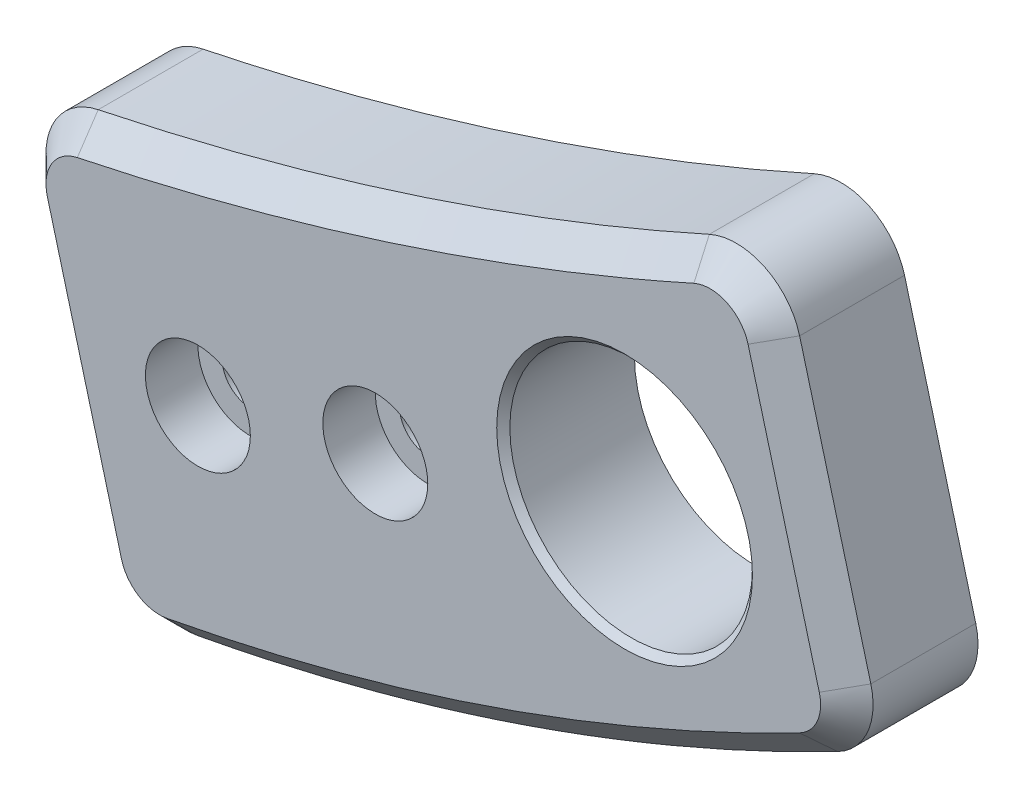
ISO-10303-21;
HEADER;
FILE_DESCRIPTION(('STEP AP214'),'2;1');
FILE_NAME('part.step','',(''),(''),'','','');
FILE_SCHEMA(('AUTOMOTIVE_DESIGN { 1 0 10303 214 1 1 1 1 }'));
ENDSEC;
DATA;
#1=APPLICATION_CONTEXT('core data for automotive mechanical design processes');
#2=APPLICATION_PROTOCOL_DEFINITION('international standard','automotive_design',2000,#1);
#3=PRODUCT_CONTEXT('',#1,'mechanical');
#4=PRODUCT('Part','Part','',(#3));
#5=PRODUCT_RELATED_PRODUCT_CATEGORY('part','',(#4));
#6=PRODUCT_DEFINITION_FORMATION('','',#4);
#7=PRODUCT_DEFINITION_CONTEXT('part definition',#1,'design');
#8=PRODUCT_DEFINITION('design','',#6,#7);
#9=PRODUCT_DEFINITION_SHAPE('','',#8);
#10=(LENGTH_UNIT() NAMED_UNIT(*) SI_UNIT(.MILLI.,.METRE.));
#11=(NAMED_UNIT(*) PLANE_ANGLE_UNIT() SI_UNIT($,.RADIAN.));
#12=(NAMED_UNIT(*) SI_UNIT($,.STERADIAN.) SOLID_ANGLE_UNIT());
#13=UNCERTAINTY_MEASURE_WITH_UNIT(LENGTH_MEASURE(1.E-05),#10,'distance_accuracy_value','');
#14=(GEOMETRIC_REPRESENTATION_CONTEXT(3) GLOBAL_UNCERTAINTY_ASSIGNED_CONTEXT((#13)) GLOBAL_UNIT_ASSIGNED_CONTEXT((#10,
#11,#12)) REPRESENTATION_CONTEXT('',''));
#15=CARTESIAN_POINT('',(0.,0.,0.));
#16=DIRECTION('',(0.,0.,1.));
#17=DIRECTION('',(1.,0.,0.));
#18=AXIS2_PLACEMENT_3D('',#15,#16,#17);
#19=CARTESIAN_POINT('',(45.7938400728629,-131.897870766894,4.));
#20=DIRECTION('',(0.,0.,1.));
#21=DIRECTION('',(-0.965925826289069,-0.25881904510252,0.));
#22=AXIS2_PLACEMENT_3D('',#19,#20,#21);
#23=ELLIPSE('',#22,130.28,94.5);
#24=DIRECTION('',(0.,0.,-1.));
#25=VECTOR('',#24,1.);
#26=SURFACE_OF_LINEAR_EXTRUSION('',#23,#25);
#27=DIRECTION('',(0.,0.,-1.));
#28=VECTOR('',#27,1.);
#29=CARTESIAN_POINT('',(105.704191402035,-209.472004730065,0.));
#30=LINE('',#29,#28);
#31=CARTESIAN_POINT('',(105.704191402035,-209.472004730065,0.));
#32=VERTEX_POINT('',#31);
#33=CARTESIAN_POINT('',(105.704191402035,-209.472004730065,7.99999999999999));
#34=VERTEX_POINT('',#33);
#35=EDGE_CURVE('E145',#32,#34,#30,.F.);
#36=ORIENTED_EDGE('',*,*,#35,.T.);
#37=CARTESIAN_POINT('',(45.7938400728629,-131.897870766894,7.99999999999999));
#38=DIRECTION('',(0.,0.,-1.));
#39=DIRECTION('',(-0.965925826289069,-0.25881904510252,0.));
#40=AXIS2_PLACEMENT_3D('',#37,#38,#39);
#41=ELLIPSE('',#40,130.28,94.5);
#42=CARTESIAN_POINT('',(56.9191718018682,-226.210883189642,7.99999999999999));
#43=VERTEX_POINT('',#42);
#44=EDGE_CURVE('E192',#34,#43,#41,.T.);
#45=ORIENTED_EDGE('',*,*,#44,.T.);
#46=DIRECTION('',(0.,0.,-1.));
#47=VECTOR('',#46,1.);
#48=CARTESIAN_POINT('',(56.9191718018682,-226.210883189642,4.));
#49=LINE('',#48,#47);
#50=CARTESIAN_POINT('',(56.9191718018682,-226.210883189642,0.));
#51=VERTEX_POINT('',#50);
#52=EDGE_CURVE('E178',#43,#51,#49,.T.);
#53=ORIENTED_EDGE('',*,*,#52,.T.);
#54=CARTESIAN_POINT('',(45.7938400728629,-131.897870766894,0.));
#55=DIRECTION('',(0.,0.,1.));
#56=DIRECTION('',(-0.965925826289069,-0.25881904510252,0.));
#57=AXIS2_PLACEMENT_3D('',#54,#55,#56);
#58=ELLIPSE('',#57,130.28,94.5);
#59=EDGE_CURVE('E153',#51,#32,#58,.T.);
#60=ORIENTED_EDGE('',*,*,#59,.T.);
#61=EDGE_LOOP('',(#36,#45,#53,#60));
#62=FACE_BOUND('',#61,.T.);
#63=ADVANCED_FACE('F33',(#62),#26,.F.);
#64=CARTESIAN_POINT('',(45.7938400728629,-131.897870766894,4.));
#65=DIRECTION('',(0.,0.,-1.));
#66=DIRECTION('',(0.965925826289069,0.25881904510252,0.));
#67=AXIS2_PLACEMENT_3D('',#64,#65,#66);
#68=ELLIPSE('',#67,120.,62.5);
#69=DIRECTION('',(0.,0.,-1.));
#70=VECTOR('',#69,1.);
#71=SURFACE_OF_LINEAR_EXTRUSION('',#68,#70);
#72=DIRECTION('',(0.,0.,-1.));
#73=VECTOR('',#72,1.);
#74=CARTESIAN_POINT('',(49.3187012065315,-195.277391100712,0.));
#75=LINE('',#74,#73);
#76=CARTESIAN_POINT('',(49.3187012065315,-195.277391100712,0.));
#77=VERTEX_POINT('',#76);
#78=CARTESIAN_POINT('',(49.3187012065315,-195.277391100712,7.99999999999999));
#79=VERTEX_POINT('',#78);
#80=EDGE_CURVE('E467',#77,#79,#75,.F.);
#81=ORIENTED_EDGE('',*,*,#80,.T.);
#82=CARTESIAN_POINT('',(45.7938400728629,-131.897870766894,7.99999999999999));
#83=DIRECTION('',(0.,0.,1.));
#84=DIRECTION('',(0.965925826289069,0.25881904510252,0.));
#85=AXIS2_PLACEMENT_3D('',#82,#83,#84);
#86=ELLIPSE('',#85,120.,62.5);
#87=CARTESIAN_POINT('',(95.916568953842,-180.206914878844,7.99999999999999));
#88=VERTEX_POINT('',#87);
#89=EDGE_CURVE('E235',#79,#88,#86,.T.);
#90=ORIENTED_EDGE('',*,*,#89,.T.);
#91=DIRECTION('',(0.,0.,-1.));
#92=VECTOR('',#91,1.);
#93=CARTESIAN_POINT('',(95.916568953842,-180.206914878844,4.));
#94=LINE('',#93,#92);
#95=CARTESIAN_POINT('',(95.916568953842,-180.206914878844,0.));
#96=VERTEX_POINT('',#95);
#97=EDGE_CURVE('E177',#88,#96,#94,.T.);
#98=ORIENTED_EDGE('',*,*,#97,.T.);
#99=CARTESIAN_POINT('',(45.7938400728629,-131.897870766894,0.));
#100=DIRECTION('',(0.,0.,-1.));
#101=DIRECTION('',(0.965925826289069,0.25881904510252,0.));
#102=AXIS2_PLACEMENT_3D('',#99,#100,#101);
#103=ELLIPSE('',#102,120.,62.5);
#104=EDGE_CURVE('E152',#96,#77,#103,.T.);
#105=ORIENTED_EDGE('',*,*,#104,.T.);
#106=EDGE_LOOP('',(#81,#90,#98,#105));
#107=FACE_BOUND('',#106,.T.);
#108=ADVANCED_FACE('F208',(#107),#71,.F.);
#109=CARTESIAN_POINT('',(-14.239497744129,-121.423692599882,0.));
#110=DIRECTION('',(0.,0.,1.));
#111=DIRECTION('',(1.,0.,0.));
#112=AXIS2_PLACEMENT_3D('',#109,#110,#111);
#113=PLANE('',#112);
#114=CARTESIAN_POINT('',(72.4467445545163,-205.413042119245,0.));
#115=DIRECTION('',(0.,0.,1.));
#116=DIRECTION('',(1.,0.,0.));
#117=AXIS2_PLACEMENT_3D('',#114,#115,#116);
#118=CIRCLE('',#117,2.15);
#119=CARTESIAN_POINT('',(74.5967445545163,-205.413042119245,0.));
#120=VERTEX_POINT('',#119);
#121=EDGE_CURVE('E37',#120,#120,#118,.T.);
#122=ORIENTED_EDGE('',*,*,#121,.T.);
#123=EDGE_LOOP('',(#122));
#124=FACE_BOUND('',#123,.T.);
#125=CARTESIAN_POINT('',(58.91880680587,-209.017886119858,0.));
#126=DIRECTION('',(0.,0.,1.));
#127=DIRECTION('',(1.,0.,0.));
#128=AXIS2_PLACEMENT_3D('',#125,#126,#127);
#129=CIRCLE('',#128,2.15);
#130=CARTESIAN_POINT('',(61.06880680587,-209.017886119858,0.));
#131=VERTEX_POINT('',#130);
#132=EDGE_CURVE('E413',#131,#131,#129,.T.);
#133=ORIENTED_EDGE('',*,*,#132,.T.);
#134=EDGE_LOOP('',(#133));
#135=FACE_BOUND('',#134,.T.);
#136=CARTESIAN_POINT('',(91.4554272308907,-199.08029427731,0.));
#137=DIRECTION('',(0.,0.,1.));
#138=DIRECTION('',(1.,0.,0.));
#139=AXIS2_PLACEMENT_3D('',#136,#137,#138);
#140=CIRCLE('',#139,9.24999999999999);
#141=CARTESIAN_POINT('',(100.705427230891,-199.08029427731,0.));
#142=VERTEX_POINT('',#141);
#143=EDGE_CURVE('E213',#142,#142,#140,.T.);
#144=ORIENTED_EDGE('',*,*,#143,.T.);
#145=EDGE_LOOP('',(#144));
#146=FACE_BOUND('',#145,.T.);
#147=ORIENTED_EDGE('',*,*,#59,.F.);
#148=CARTESIAN_POINT('',(55.9972256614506,-221.296616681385,0.));
#149=DIRECTION('',(0.,0.,1.));
#150=DIRECTION('',(1.,0.,0.));
#151=AXIS2_PLACEMENT_3D('',#148,#149,#150);
#152=CIRCLE('',#151,5.);
#153=CARTESIAN_POINT('',(51.1675965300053,-222.590711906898,0.));
#154=VERTEX_POINT('',#153);
#155=EDGE_CURVE('E472',#51,#154,#152,.F.);
#156=ORIENTED_EDGE('',*,*,#155,.T.);
#157=DIRECTION('',(0.258819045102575,-0.965925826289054,0.));
#158=VECTOR('',#157,1.);
#159=CARTESIAN_POINT('',(44.1217640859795,-196.295307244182,0.));
#160=LINE('',#159,#158);
#161=CARTESIAN_POINT('',(45.5074299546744,-201.466682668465,0.));
#162=VERTEX_POINT('',#161);
#163=EDGE_CURVE('E157',#162,#154,#160,.T.);
#164=ORIENTED_EDGE('',*,*,#163,.F.);
#165=CARTESIAN_POINT('',(50.3370590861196,-200.172587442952,0.));
#166=DIRECTION('',(0.,0.,1.));
#167=DIRECTION('',(1.,0.,0.));
#168=AXIS2_PLACEMENT_3D('',#165,#166,#167);
#169=CIRCLE('',#168,5.);
#170=EDGE_CURVE('E182',#162,#77,#169,.F.);
#171=ORIENTED_EDGE('',*,*,#170,.T.);
#172=ORIENTED_EDGE('',*,*,#104,.F.);
#173=CARTESIAN_POINT('',(97.9723479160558,-184.76474033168,0.));
#174=DIRECTION('',(0.,0.,1.));
#175=DIRECTION('',(1.,0.,0.));
#176=AXIS2_PLACEMENT_3D('',#173,#174,#175);
#177=CIRCLE('',#176,5.);
#178=CARTESIAN_POINT('',(102.801977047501,-183.470645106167,0.));
#179=VERTEX_POINT('',#178);
#180=EDGE_CURVE('E137',#96,#179,#177,.F.);
#181=ORIENTED_EDGE('',*,*,#180,.T.);
#182=DIRECTION('',(-0.25881904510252,0.965925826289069,0.));
#183=VECTOR('',#182,1.);
#184=CARTESIAN_POINT('',(101.257172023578,-177.705354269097,0.));
#185=LINE('',#184,#183);
#186=CARTESIAN_POINT('',(108.232821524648,-203.738832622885,0.));
#187=VERTEX_POINT('',#186);
#188=EDGE_CURVE('E131',#187,#179,#185,.T.);
#189=ORIENTED_EDGE('',*,*,#188,.F.);
#190=CARTESIAN_POINT('',(103.403192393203,-205.032927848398,0.));
#191=DIRECTION('',(0.,0.,1.));
#192=DIRECTION('',(1.,0.,0.));
#193=AXIS2_PLACEMENT_3D('',#190,#191,#192);
#194=CIRCLE('',#193,5.);
#195=EDGE_CURVE('E142',#187,#32,#194,.F.);
#196=ORIENTED_EDGE('',*,*,#195,.T.);
#197=EDGE_LOOP('',(#147,#156,#164,#171,#172,#181,#189,#196));
#198=FACE_BOUND('',#197,.T.);
#199=ADVANCED_FACE('F149',(#124,#135,#146,#198),#113,.F.);
#200=CARTESIAN_POINT('',(101.257172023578,-177.705354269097,4.));
#201=DIRECTION('',(-0.965925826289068,-0.25881904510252,0.));
#202=DIRECTION('',(0.25881904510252,-0.965925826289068,0.));
#203=AXIS2_PLACEMENT_3D('',#200,#201,#202);
#204=PLANE('',#203);
#205=DIRECTION('',(0.,0.,-1.));
#206=VECTOR('',#205,1.);
#207=CARTESIAN_POINT('',(102.801977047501,-183.470645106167,4.));
#208=LINE('',#207,#206);
#209=CARTESIAN_POINT('',(102.801977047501,-183.470645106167,7.99999999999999));
#210=VERTEX_POINT('',#209);
#211=EDGE_CURVE('E138',#179,#210,#208,.F.);
#212=ORIENTED_EDGE('',*,*,#211,.T.);
#213=DIRECTION('',(0.25881904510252,-0.965925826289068,0.));
#214=VECTOR('',#213,1.);
#215=CARTESIAN_POINT('',(108.232821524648,-203.738832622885,7.99999999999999));
#216=LINE('',#215,#214);
#217=CARTESIAN_POINT('',(108.232821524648,-203.738832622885,7.99999999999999));
#218=VERTEX_POINT('',#217);
#219=EDGE_CURVE('E134',#210,#218,#216,.T.);
#220=ORIENTED_EDGE('',*,*,#219,.T.);
#221=DIRECTION('',(0.,0.,-1.));
#222=VECTOR('',#221,1.);
#223=CARTESIAN_POINT('',(108.232821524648,-203.738832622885,4.));
#224=LINE('',#223,#222);
#225=EDGE_CURVE('E126',#218,#187,#224,.T.);
#226=ORIENTED_EDGE('',*,*,#225,.T.);
#227=ORIENTED_EDGE('',*,*,#188,.T.);
#228=EDGE_LOOP('',(#212,#220,#226,#227));
#229=FACE_BOUND('',#228,.T.);
#230=ADVANCED_FACE('F129',(#229),#204,.F.);
#231=CARTESIAN_POINT('',(103.403192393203,-205.032927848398,2.));
#232=DIRECTION('',(0.,0.,-1.));
#233=DIRECTION('',(-1.,0.,0.));
#234=AXIS2_PLACEMENT_3D('',#231,#232,#233);
#235=CYLINDRICAL_SURFACE('',#234,5.);
#236=ORIENTED_EDGE('',*,*,#225,.F.);
#237=CARTESIAN_POINT('',(103.403192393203,-205.032927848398,7.99999999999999));
#238=DIRECTION('',(0.,0.,1.));
#239=DIRECTION('',(1.,0.,0.));
#240=AXIS2_PLACEMENT_3D('',#237,#238,#239);
#241=CIRCLE('',#240,5.);
#242=EDGE_CURVE('E239',#218,#34,#241,.F.);
#243=ORIENTED_EDGE('',*,*,#242,.T.);
#244=ORIENTED_EDGE('',*,*,#35,.F.);
#245=ORIENTED_EDGE('',*,*,#195,.F.);
#246=EDGE_LOOP('',(#236,#243,#244,#245));
#247=FACE_BOUND('',#246,.T.);
#248=ADVANCED_FACE('F143',(#247),#235,.T.);
#249=CARTESIAN_POINT('',(97.9723479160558,-184.76474033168,2.));
#250=DIRECTION('',(0.,0.,-1.));
#251=DIRECTION('',(-1.,0.,0.));
#252=AXIS2_PLACEMENT_3D('',#249,#250,#251);
#253=CYLINDRICAL_SURFACE('',#252,5.);
#254=ORIENTED_EDGE('',*,*,#97,.F.);
#255=CARTESIAN_POINT('',(97.9723479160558,-184.76474033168,7.99999999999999));
#256=DIRECTION('',(0.,0.,1.));
#257=DIRECTION('',(1.,0.,0.));
#258=AXIS2_PLACEMENT_3D('',#255,#256,#257);
#259=CIRCLE('',#258,5.);
#260=EDGE_CURVE('E228',#88,#210,#259,.F.);
#261=ORIENTED_EDGE('',*,*,#260,.T.);
#262=ORIENTED_EDGE('',*,*,#211,.F.);
#263=ORIENTED_EDGE('',*,*,#180,.F.);
#264=EDGE_LOOP('',(#254,#261,#262,#263));
#265=FACE_BOUND('',#264,.T.);
#266=ADVANCED_FACE('F494',(#265),#253,.T.);
#267=CARTESIAN_POINT('',(44.1217640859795,-196.295307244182,0.));
#268=DIRECTION('',(-0.965925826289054,-0.258819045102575,0.));
#269=DIRECTION('',(0.258819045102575,-0.965925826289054,0.));
#270=AXIS2_PLACEMENT_3D('',#267,#268,#269);
#271=PLANE('',#270);
#272=DIRECTION('',(0.,0.,1.));
#273=VECTOR('',#272,1.);
#274=CARTESIAN_POINT('',(51.1675965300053,-222.590711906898,4.));
#275=LINE('',#274,#273);
#276=CARTESIAN_POINT('',(51.1675965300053,-222.590711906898,7.99999999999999));
#277=VERTEX_POINT('',#276);
#278=EDGE_CURVE('E176',#154,#277,#275,.T.);
#279=ORIENTED_EDGE('',*,*,#278,.T.);
#280=DIRECTION('',(-0.258819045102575,0.965925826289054,0.));
#281=VECTOR('',#280,1.);
#282=CARTESIAN_POINT('',(44.1217640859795,-196.295307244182,7.99999999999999));
#283=LINE('',#282,#281);
#284=CARTESIAN_POINT('',(45.5074299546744,-201.466682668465,7.99999999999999));
#285=VERTEX_POINT('',#284);
#286=EDGE_CURVE('E50',#277,#285,#283,.T.);
#287=ORIENTED_EDGE('',*,*,#286,.T.);
#288=DIRECTION('',(0.,0.,1.));
#289=VECTOR('',#288,1.);
#290=CARTESIAN_POINT('',(45.5074299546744,-201.466682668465,0.));
#291=LINE('',#290,#289);
#292=EDGE_CURVE('E174',#285,#162,#291,.F.);
#293=ORIENTED_EDGE('',*,*,#292,.T.);
#294=ORIENTED_EDGE('',*,*,#163,.T.);
#295=EDGE_LOOP('',(#279,#287,#293,#294));
#296=FACE_BOUND('',#295,.T.);
#297=ADVANCED_FACE('F490',(#296),#271,.T.);
#298=CARTESIAN_POINT('',(55.9972256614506,-221.296616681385,2.));
#299=DIRECTION('',(0.,0.,-1.));
#300=DIRECTION('',(-1.,0.,0.));
#301=AXIS2_PLACEMENT_3D('',#298,#299,#300);
#302=CYLINDRICAL_SURFACE('',#301,5.);
#303=ORIENTED_EDGE('',*,*,#52,.F.);
#304=CARTESIAN_POINT('',(55.9972256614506,-221.296616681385,7.99999999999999));
#305=DIRECTION('',(0.,0.,1.));
#306=DIRECTION('',(1.,0.,0.));
#307=AXIS2_PLACEMENT_3D('',#304,#305,#306);
#308=CIRCLE('',#307,5.);
#309=EDGE_CURVE('E58',#43,#277,#308,.F.);
#310=ORIENTED_EDGE('',*,*,#309,.T.);
#311=ORIENTED_EDGE('',*,*,#278,.F.);
#312=ORIENTED_EDGE('',*,*,#155,.F.);
#313=EDGE_LOOP('',(#303,#310,#311,#312));
#314=FACE_BOUND('',#313,.T.);
#315=ADVANCED_FACE('F493',(#314),#302,.T.);
#316=CARTESIAN_POINT('',(50.3370590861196,-200.172587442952,2.));
#317=DIRECTION('',(0.,0.,-1.));
#318=DIRECTION('',(-1.,0.,0.));
#319=AXIS2_PLACEMENT_3D('',#316,#317,#318);
#320=CYLINDRICAL_SURFACE('',#319,5.);
#321=ORIENTED_EDGE('',*,*,#292,.F.);
#322=CARTESIAN_POINT('',(50.3370590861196,-200.172587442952,7.99999999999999));
#323=DIRECTION('',(0.,0.,1.));
#324=DIRECTION('',(1.,0.,0.));
#325=AXIS2_PLACEMENT_3D('',#322,#323,#324);
#326=CIRCLE('',#325,5.);
#327=EDGE_CURVE('E242',#285,#79,#326,.F.);
#328=ORIENTED_EDGE('',*,*,#327,.T.);
#329=ORIENTED_EDGE('',*,*,#80,.F.);
#330=ORIENTED_EDGE('',*,*,#170,.F.);
#331=EDGE_LOOP('',(#321,#328,#329,#330));
#332=FACE_BOUND('',#331,.T.);
#333=ADVANCED_FACE('F289',(#332),#320,.T.);
#334=CARTESIAN_POINT('',(45.7938400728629,-131.897870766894,10.));
#335=DIRECTION('',(0.,0.,1.));
#336=DIRECTION('',(1.,0.,0.));
#337=AXIS2_PLACEMENT_3D('',#334,#335,#336);
#338=PLANE('',#337);
#339=CARTESIAN_POINT('',(72.4467445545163,-205.413042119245,10.));
#340=DIRECTION('',(0.,0.,1.));
#341=DIRECTION('',(1.,0.,0.));
#342=AXIS2_PLACEMENT_3D('',#339,#340,#341);
#343=CIRCLE('',#342,4.);
#344=CARTESIAN_POINT('',(76.4467445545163,-205.413042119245,10.));
#345=VERTEX_POINT('',#344);
#346=EDGE_CURVE('E435',#345,#345,#343,.T.);
#347=ORIENTED_EDGE('',*,*,#346,.F.);
#348=EDGE_LOOP('',(#347));
#349=FACE_BOUND('',#348,.T.);
#350=CARTESIAN_POINT('',(58.91880680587,-209.017886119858,10.));
#351=DIRECTION('',(0.,0.,1.));
#352=DIRECTION('',(1.,0.,0.));
#353=AXIS2_PLACEMENT_3D('',#350,#351,#352);
#354=CIRCLE('',#353,4.);
#355=CARTESIAN_POINT('',(62.91880680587,-209.017886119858,10.));
#356=VERTEX_POINT('',#355);
#357=EDGE_CURVE('E424',#356,#356,#354,.T.);
#358=ORIENTED_EDGE('',*,*,#357,.F.);
#359=EDGE_LOOP('',(#358));
#360=FACE_BOUND('',#359,.T.);
#361=CARTESIAN_POINT('',(91.4554272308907,-199.08029427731,10.));
#362=DIRECTION('',(0.,0.,1.));
#363=DIRECTION('',(1.,0.,0.));
#364=AXIS2_PLACEMENT_3D('',#361,#362,#363);
#365=CIRCLE('',#364,9.75000000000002);
#366=CARTESIAN_POINT('',(101.205427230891,-199.08029427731,10.));
#367=VERTEX_POINT('',#366);
#368=EDGE_CURVE('E12',#367,#367,#365,.F.);
#369=ORIENTED_EDGE('',*,*,#368,.T.);
#370=EDGE_LOOP('',(#369));
#371=FACE_BOUND('',#370,.T.);
#372=CARTESIAN_POINT('',(97.9723479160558,-184.76474033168,10.));
#373=DIRECTION('',(0.,0.,1.));
#374=DIRECTION('',(1.,0.,0.));
#375=AXIS2_PLACEMENT_3D('',#372,#373,#374);
#376=CIRCLE('',#375,3.00000000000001);
#377=CARTESIAN_POINT('',(100.870125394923,-183.988283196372,10.));
#378=VERTEX_POINT('',#377);
#379=CARTESIAN_POINT('',(96.7388805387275,-182.030045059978,10.));
#380=VERTEX_POINT('',#379);
#381=EDGE_CURVE('E449',#378,#380,#376,.T.);
#382=ORIENTED_EDGE('',*,*,#381,.T.);
#383=CARTESIAN_POINT('',(49.7260443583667,-197.235469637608,10.));
#384=CARTESIAN_POINT('',(65.9399743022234,-193.845819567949,9.99999999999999));
#385=CARTESIAN_POINT('',(81.6269983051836,-188.827057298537,10.));
#386=CARTESIAN_POINT('',(96.7388805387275,-182.030045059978,10.));
#387=B_SPLINE_CURVE_WITH_KNOTS('',3,(#383,#384,#385,#386),.UNSPECIFIED.,.F.,.F.,(4,4),(0.,
0.049410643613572),.UNSPECIFIED.);
#388=CARTESIAN_POINT('',(49.7260443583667,-197.235469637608,10.));
#389=VERTEX_POINT('',#388);
#390=EDGE_CURVE('E450',#380,#389,#387,.F.);
#391=ORIENTED_EDGE('',*,*,#390,.T.);
#392=CARTESIAN_POINT('',(50.3370590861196,-200.172587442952,10.));
#393=DIRECTION('',(0.,0.,1.));
#394=DIRECTION('',(1.,0.,0.));
#395=AXIS2_PLACEMENT_3D('',#392,#393,#394);
#396=CIRCLE('',#395,3.);
#397=CARTESIAN_POINT('',(47.4392816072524,-200.949044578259,10.));
#398=VERTEX_POINT('',#397);
#399=EDGE_CURVE('E464',#389,#398,#396,.T.);
#400=ORIENTED_EDGE('',*,*,#399,.T.);
#401=DIRECTION('',(0.258819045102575,-0.965925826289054,0.));
#402=VECTOR('',#401,1.);
#403=CARTESIAN_POINT('',(30.0662644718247,-136.112061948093,10.));
#404=LINE('',#403,#402);
#405=CARTESIAN_POINT('',(53.0994481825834,-222.073073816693,10.));
#406=VERTEX_POINT('',#405);
#407=EDGE_CURVE('E466',#398,#406,#404,.T.);
#408=ORIENTED_EDGE('',*,*,#407,.T.);
#409=CARTESIAN_POINT('',(55.9972256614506,-221.296616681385,10.));
#410=DIRECTION('',(0.,0.,1.));
#411=DIRECTION('',(1.,0.,0.));
#412=AXIS2_PLACEMENT_3D('',#409,#410,#411);
#413=CIRCLE('',#412,2.99999999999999);
#414=CARTESIAN_POINT('',(56.5503933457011,-224.245176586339,10.));
#415=VERTEX_POINT('',#414);
#416=EDGE_CURVE('E476',#406,#415,#413,.T.);
#417=ORIENTED_EDGE('',*,*,#416,.T.);
#418=CARTESIAN_POINT('',(104.783791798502,-207.696373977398,10.));
#419=CARTESIAN_POINT('',(89.519480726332,-215.583647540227,9.99999999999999));
#420=CARTESIAN_POINT('',(73.4270835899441,-221.057368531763,10.));
#421=CARTESIAN_POINT('',(56.5503933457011,-224.245176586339,10.));
#422=B_SPLINE_CURVE_WITH_KNOTS('',3,(#418,#419,#420,#421),.UNSPECIFIED.,.F.,.F.,(4,4),(0.,
0.0509933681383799),.UNSPECIFIED.);
#423=CARTESIAN_POINT('',(104.783791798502,-207.696373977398,10.));
#424=VERTEX_POINT('',#423);
#425=EDGE_CURVE('E403',#415,#424,#422,.F.);
#426=ORIENTED_EDGE('',*,*,#425,.T.);
#427=CARTESIAN_POINT('',(103.403192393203,-205.032927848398,10.));
#428=DIRECTION('',(0.,0.,1.));
#429=DIRECTION('',(1.,0.,0.));
#430=AXIS2_PLACEMENT_3D('',#427,#428,#429);
#431=CIRCLE('',#430,2.99999999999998);
#432=CARTESIAN_POINT('',(106.30096987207,-204.25647071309,10.));
#433=VERTEX_POINT('',#432);
#434=EDGE_CURVE('E456',#424,#433,#431,.T.);
#435=ORIENTED_EDGE('',*,*,#434,.T.);
#436=DIRECTION('',(-0.25881904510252,0.965925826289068,0.));
#437=VECTOR('',#436,1.);
#438=CARTESIAN_POINT('',(100.870125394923,-183.988283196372,10.));
#439=LINE('',#438,#437);
#440=EDGE_CURVE('E453',#433,#378,#439,.T.);
#441=ORIENTED_EDGE('',*,*,#440,.T.);
#442=EDGE_LOOP('',(#382,#391,#400,#408,#417,#426,#435,#441));
#443=FACE_BOUND('',#442,.T.);
#444=ADVANCED_FACE('F378',(#349,#360,#371,#443),#338,.T.);
#445=CARTESIAN_POINT('',(56.5503933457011,-224.245176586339,10.));
#446=CARTESIAN_POINT('',(73.4270835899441,-221.057368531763,10.));
#447=CARTESIAN_POINT('',(89.519480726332,-215.583647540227,9.99999999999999));
#448=CARTESIAN_POINT('',(104.783791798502,-207.696373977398,10.));
#449=CARTESIAN_POINT('',(56.9191718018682,-226.210883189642,7.99999999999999));
#450=CARTESIAN_POINT('',(73.9873508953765,-222.986543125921,7.99999999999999));
#451=CARTESIAN_POINT('',(90.2570401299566,-217.453363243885,7.99999999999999));
#452=CARTESIAN_POINT('',(105.704191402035,-209.472004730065,7.99999999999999));
#453=B_SPLINE_SURFACE_WITH_KNOTS('',1,3,((#445,#446,#447,#448),(#449,#450,#451,#452)),
.UNSPECIFIED.,.F.,.F.,.F.,(2,2),(4,4),(0.,1.),(0.,0.0509933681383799),.UNSPECIFIED.);
#454=CARTESIAN_POINT('',(56.5503933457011,-224.245176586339,10.));
#455=CARTESIAN_POINT('',(56.9191718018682,-226.210883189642,7.99999999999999));
#456=B_SPLINE_CURVE_WITH_KNOTS('',1,(#454,#455),.UNSPECIFIED.,.F.,.F.,(2,2),(0.,1.),.UNSPECIFIED.);
#457=EDGE_CURVE('E262',#43,#415,#456,.F.);
#458=CARTESIAN_POINT('',(105.704191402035,-209.472004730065,7.99999999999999));
#459=CARTESIAN_POINT('',(104.783791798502,-207.696373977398,10.));
#460=B_SPLINE_CURVE_WITH_KNOTS('',1,(#458,#459),.UNSPECIFIED.,.F.,.F.,(2,2),(0.,1.),.UNSPECIFIED.);
#461=EDGE_CURVE('E173',#424,#34,#460,.F.);
#462=ORIENTED_EDGE('',*,*,#457,.F.);
#463=ORIENTED_EDGE('',*,*,#44,.F.);
#464=ORIENTED_EDGE('',*,*,#461,.F.);
#465=ORIENTED_EDGE('',*,*,#425,.F.);
#466=EDGE_LOOP('',(#462,#463,#464,#465));
#467=FACE_BOUND('',#466,.T.);
#468=ADVANCED_FACE('F368',(#467),#453,.T.);
#469=CARTESIAN_POINT('',(103.403192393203,-205.032927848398,10.));
#470=DIRECTION('',(0.,0.,-1.));
#471=DIRECTION('',(-1.,0.,0.));
#472=AXIS2_PLACEMENT_3D('',#469,#470,#471);
#473=CONICAL_SURFACE('',#472,2.99999999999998,0.78539816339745);
#474=ORIENTED_EDGE('',*,*,#461,.T.);
#475=ORIENTED_EDGE('',*,*,#242,.F.);
#476=DIRECTION('',(0.683012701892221,0.183012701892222,-0.707106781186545));
#477=VECTOR('',#476,1.);
#478=CARTESIAN_POINT('',(106.30096987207,-204.25647071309,10.));
#479=LINE('',#478,#477);
#480=EDGE_CURVE('E259',#433,#218,#479,.T.);
#481=ORIENTED_EDGE('',*,*,#480,.F.);
#482=ORIENTED_EDGE('',*,*,#434,.F.);
#483=EDGE_LOOP('',(#474,#475,#481,#482));
#484=FACE_BOUND('',#483,.T.);
#485=ADVANCED_FACE('F345',(#484),#473,.T.);
#486=CARTESIAN_POINT('',(55.9972256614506,-221.296616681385,10.));
#487=DIRECTION('',(0.,0.,-1.));
#488=DIRECTION('',(-1.,0.,0.));
#489=AXIS2_PLACEMENT_3D('',#486,#487,#488);
#490=CONICAL_SURFACE('',#489,3.,0.785398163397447);
#491=ORIENTED_EDGE('',*,*,#457,.T.);
#492=ORIENTED_EDGE('',*,*,#416,.F.);
#493=DIRECTION('',(0.683012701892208,0.183012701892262,0.707106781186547));
#494=VECTOR('',#493,1.);
#495=CARTESIAN_POINT('',(51.1675965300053,-222.590711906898,7.99999999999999));
#496=LINE('',#495,#494);
#497=EDGE_CURVE('E256',#277,#406,#496,.T.);
#498=ORIENTED_EDGE('',*,*,#497,.F.);
#499=ORIENTED_EDGE('',*,*,#309,.F.);
#500=EDGE_LOOP('',(#491,#492,#498,#499));
#501=FACE_BOUND('',#500,.T.);
#502=ADVANCED_FACE('F340',(#501),#490,.T.);
#503=CARTESIAN_POINT('',(84.1581107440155,-121.61819542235,10.));
#504=DIRECTION('',(0.683012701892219,0.183012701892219,0.707106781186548));
#505=DIRECTION('',(0.719254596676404,0.,-0.694746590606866));
#506=AXIS2_PLACEMENT_3D('',#503,#504,#505);
#507=PLANE('',#506);
#508=ORIENTED_EDGE('',*,*,#480,.T.);
#509=ORIENTED_EDGE('',*,*,#219,.F.);
#510=DIRECTION('',(0.683012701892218,0.183012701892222,-0.707106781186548));
#511=VECTOR('',#510,1.);
#512=CARTESIAN_POINT('',(100.870125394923,-183.988283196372,10.));
#513=LINE('',#512,#511);
#514=EDGE_CURVE('E252',#378,#210,#513,.T.);
#515=ORIENTED_EDGE('',*,*,#514,.F.);
#516=ORIENTED_EDGE('',*,*,#440,.F.);
#517=EDGE_LOOP('',(#508,#509,#515,#516));
#518=FACE_BOUND('',#517,.T.);
#519=ADVANCED_FACE('F336',(#518),#507,.T.);
#520=CARTESIAN_POINT('',(30.0662644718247,-136.112061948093,10.));
#521=DIRECTION('',(0.683012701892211,0.183012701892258,-0.707106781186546));
#522=DIRECTION('',(-0.719254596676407,0.,-0.694746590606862));
#523=AXIS2_PLACEMENT_3D('',#520,#521,#522);
#524=PLANE('',#523);
#525=ORIENTED_EDGE('',*,*,#497,.T.);
#526=ORIENTED_EDGE('',*,*,#407,.F.);
#527=DIRECTION('',(0.683012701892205,0.183012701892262,0.70710678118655));
#528=VECTOR('',#527,1.);
#529=CARTESIAN_POINT('',(45.5074299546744,-201.466682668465,7.99999999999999));
#530=LINE('',#529,#528);
#531=EDGE_CURVE('E249',#285,#398,#530,.T.);
#532=ORIENTED_EDGE('',*,*,#531,.F.);
#533=ORIENTED_EDGE('',*,*,#286,.F.);
#534=EDGE_LOOP('',(#525,#526,#532,#533));
#535=FACE_BOUND('',#534,.T.);
#536=ADVANCED_FACE('F333',(#535),#524,.F.);
#537=CARTESIAN_POINT('',(97.9723479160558,-184.76474033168,10.));
#538=DIRECTION('',(0.,0.,-1.));
#539=DIRECTION('',(-1.,0.,0.));
#540=AXIS2_PLACEMENT_3D('',#537,#538,#539);
#541=CONICAL_SURFACE('',#540,2.99999999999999,0.785398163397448);
#542=ORIENTED_EDGE('',*,*,#514,.T.);
#543=ORIENTED_EDGE('',*,*,#260,.F.);
#544=CARTESIAN_POINT('',(96.7388805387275,-182.030045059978,10.));
#545=CARTESIAN_POINT('',(95.916568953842,-180.206914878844,7.99999999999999));
#546=B_SPLINE_CURVE_WITH_KNOTS('',1,(#544,#545),.UNSPECIFIED.,.F.,.F.,(2,2),(0.,1.),.UNSPECIFIED.);
#547=EDGE_CURVE('E253',#380,#88,#546,.T.);
#548=ORIENTED_EDGE('',*,*,#547,.F.);
#549=ORIENTED_EDGE('',*,*,#381,.F.);
#550=EDGE_LOOP('',(#542,#543,#548,#549));
#551=FACE_BOUND('',#550,.T.);
#552=ADVANCED_FACE('F324',(#551),#541,.T.);
#553=CARTESIAN_POINT('',(50.3370590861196,-200.172587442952,10.));
#554=DIRECTION('',(0.,0.,-1.));
#555=DIRECTION('',(-1.,0.,0.));
#556=AXIS2_PLACEMENT_3D('',#553,#554,#555);
#557=CONICAL_SURFACE('',#556,3.,0.785398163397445);
#558=ORIENTED_EDGE('',*,*,#531,.T.);
#559=ORIENTED_EDGE('',*,*,#399,.F.);
#560=CARTESIAN_POINT('',(49.3187012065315,-195.277391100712,7.99999999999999));
#561=CARTESIAN_POINT('',(49.7260443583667,-197.235469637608,10.));
#562=B_SPLINE_CURVE_WITH_KNOTS('',1,(#560,#561),.UNSPECIFIED.,.F.,.F.,(2,2),(0.,1.),.UNSPECIFIED.);
#563=EDGE_CURVE('E268',#79,#389,#562,.T.);
#564=ORIENTED_EDGE('',*,*,#563,.F.);
#565=ORIENTED_EDGE('',*,*,#327,.F.);
#566=EDGE_LOOP('',(#558,#559,#564,#565));
#567=FACE_BOUND('',#566,.T.);
#568=ADVANCED_FACE('F288',(#567),#557,.T.);
#569=CARTESIAN_POINT('',(96.7388805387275,-182.030045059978,10.));
#570=CARTESIAN_POINT('',(81.6269983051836,-188.827057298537,10.));
#571=CARTESIAN_POINT('',(65.9399743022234,-193.845819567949,9.99999999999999));
#572=CARTESIAN_POINT('',(49.7260443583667,-197.235469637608,10.));
#573=CARTESIAN_POINT('',(95.916568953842,-180.206914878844,7.99999999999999));
#574=CARTESIAN_POINT('',(80.948310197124,-186.939678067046,7.99999999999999));
#575=CARTESIAN_POINT('',(65.3912848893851,-191.917628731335,7.99999999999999));
#576=CARTESIAN_POINT('',(49.3187012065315,-195.277391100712,7.99999999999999));
#577=B_SPLINE_SURFACE_WITH_KNOTS('',1,3,((#569,#570,#571,#572),(#573,#574,#575,#576)),
.UNSPECIFIED.,.F.,.F.,.F.,(2,2),(4,4),(0.,1.),(0.,0.049410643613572),.UNSPECIFIED.);
#578=ORIENTED_EDGE('',*,*,#547,.T.);
#579=ORIENTED_EDGE('',*,*,#89,.F.);
#580=ORIENTED_EDGE('',*,*,#563,.T.);
#581=ORIENTED_EDGE('',*,*,#390,.F.);
#582=EDGE_LOOP('',(#578,#579,#580,#581));
#583=FACE_BOUND('',#582,.T.);
#584=ADVANCED_FACE('F275',(#583),#577,.T.);
#585=CARTESIAN_POINT('',(91.4554272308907,-199.08029427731,10.));
#586=DIRECTION('',(0.,0.,1.));
#587=DIRECTION('',(1.,0.,0.));
#588=AXIS2_PLACEMENT_3D('',#585,#586,#587);
#589=CYLINDRICAL_SURFACE('',#588,9.24999999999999);
#590=CARTESIAN_POINT('',(91.4554272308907,-199.08029427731,9.49999999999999));
#591=DIRECTION('',(0.,0.,1.));
#592=DIRECTION('',(1.,0.,0.));
#593=AXIS2_PLACEMENT_3D('',#590,#591,#592);
#594=CIRCLE('',#593,9.24999999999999);
#595=CARTESIAN_POINT('',(100.705427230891,-199.08029427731,9.49999999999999));
#596=VERTEX_POINT('',#595);
#597=EDGE_CURVE('E42',#596,#596,#594,.T.);
#598=ORIENTED_EDGE('',*,*,#597,.T.);
#599=EDGE_LOOP('',(#598));
#600=FACE_BOUND('',#599,.T.);
#601=ORIENTED_EDGE('',*,*,#143,.F.);
#602=EDGE_LOOP('',(#601));
#603=FACE_BOUND('',#602,.T.);
#604=ADVANCED_FACE('F287',(#600,#603),#589,.F.);
#605=CARTESIAN_POINT('',(91.4554272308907,-199.08029427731,9.49999999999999));
#606=DIRECTION('',(0.,0.,1.));
#607=DIRECTION('',(1.,0.,0.));
#608=AXIS2_PLACEMENT_3D('',#605,#606,#607);
#609=CONICAL_SURFACE('',#608,9.24999999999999,0.785398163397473);
#610=ORIENTED_EDGE('',*,*,#368,.F.);
#611=EDGE_LOOP('',(#610));
#612=FACE_BOUND('',#611,.T.);
#613=ORIENTED_EDGE('',*,*,#597,.F.);
#614=EDGE_LOOP('',(#613));
#615=FACE_BOUND('',#614,.T.);
#616=ADVANCED_FACE('F35',(#612,#615),#609,.F.);
#617=CARTESIAN_POINT('',(58.91880680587,-209.017886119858,10.));
#618=DIRECTION('',(0.,0.,1.));
#619=DIRECTION('',(1.,0.,0.));
#620=AXIS2_PLACEMENT_3D('',#617,#618,#619);
#621=CYLINDRICAL_SURFACE('',#620,2.15);
#622=CARTESIAN_POINT('',(58.91880680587,-209.017886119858,6.));
#623=DIRECTION('',(0.,0.,1.));
#624=DIRECTION('',(1.,0.,0.));
#625=AXIS2_PLACEMENT_3D('',#622,#623,#624);
#626=CIRCLE('',#625,2.15);
#627=CARTESIAN_POINT('',(61.06880680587,-209.017886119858,6.));
#628=VERTEX_POINT('',#627);
#629=EDGE_CURVE('E415',#628,#628,#626,.T.);
#630=ORIENTED_EDGE('',*,*,#629,.T.);
#631=EDGE_LOOP('',(#630));
#632=FACE_BOUND('',#631,.T.);
#633=ORIENTED_EDGE('',*,*,#132,.F.);
#634=EDGE_LOOP('',(#633));
#635=FACE_BOUND('',#634,.T.);
#636=ADVANCED_FACE('F568',(#632,#635),#621,.F.);
#637=CARTESIAN_POINT('',(61.06880680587,-209.017886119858,6.));
#638=DIRECTION('',(0.,0.,-1.));
#639=DIRECTION('',(-1.,0.,0.));
#640=AXIS2_PLACEMENT_3D('',#637,#638,#639);
#641=PLANE('',#640);
#642=ORIENTED_EDGE('',*,*,#629,.F.);
#643=EDGE_LOOP('',(#642));
#644=FACE_BOUND('',#643,.T.);
#645=CARTESIAN_POINT('',(58.91880680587,-209.017886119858,6.));
#646=DIRECTION('',(0.,0.,1.));
#647=DIRECTION('',(1.,0.,0.));
#648=AXIS2_PLACEMENT_3D('',#645,#646,#647);
#649=CIRCLE('',#648,4.);
#650=CARTESIAN_POINT('',(62.91880680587,-209.017886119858,6.));
#651=VERTEX_POINT('',#650);
#652=EDGE_CURVE('E420',#651,#651,#649,.T.);
#653=ORIENTED_EDGE('',*,*,#652,.T.);
#654=EDGE_LOOP('',(#653));
#655=FACE_BOUND('',#654,.T.);
#656=ADVANCED_FACE('F576',(#644,#655),#641,.F.);
#657=CARTESIAN_POINT('',(58.91880680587,-209.017886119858,10.));
#658=DIRECTION('',(0.,0.,1.));
#659=DIRECTION('',(1.,0.,0.));
#660=AXIS2_PLACEMENT_3D('',#657,#658,#659);
#661=CYLINDRICAL_SURFACE('',#660,4.);
#662=ORIENTED_EDGE('',*,*,#652,.F.);
#663=EDGE_LOOP('',(#662));
#664=FACE_BOUND('',#663,.T.);
#665=ORIENTED_EDGE('',*,*,#357,.T.);
#666=EDGE_LOOP('',(#665));
#667=FACE_BOUND('',#666,.T.);
#668=ADVANCED_FACE('F583',(#664,#667),#661,.F.);
#669=CARTESIAN_POINT('',(72.4467445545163,-205.413042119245,10.));
#670=DIRECTION('',(0.,0.,1.));
#671=DIRECTION('',(1.,0.,0.));
#672=AXIS2_PLACEMENT_3D('',#669,#670,#671);
#673=CYLINDRICAL_SURFACE('',#672,2.15);
#674=CARTESIAN_POINT('',(72.4467445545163,-205.413042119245,6.));
#675=DIRECTION('',(0.,0.,1.));
#676=DIRECTION('',(1.,0.,0.));
#677=AXIS2_PLACEMENT_3D('',#674,#675,#676);
#678=CIRCLE('',#677,2.15);
#679=CARTESIAN_POINT('',(74.5967445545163,-205.413042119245,6.));
#680=VERTEX_POINT('',#679);
#681=EDGE_CURVE('E429',#680,#680,#678,.T.);
#682=ORIENTED_EDGE('',*,*,#681,.T.);
#683=EDGE_LOOP('',(#682));
#684=FACE_BOUND('',#683,.T.);
#685=ORIENTED_EDGE('',*,*,#121,.F.);
#686=EDGE_LOOP('',(#685));
#687=FACE_BOUND('',#686,.T.);
#688=ADVANCED_FACE('F591',(#684,#687),#673,.F.);
#689=CARTESIAN_POINT('',(74.5967445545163,-205.413042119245,6.));
#690=DIRECTION('',(0.,0.,-1.));
#691=DIRECTION('',(-1.,0.,0.));
#692=AXIS2_PLACEMENT_3D('',#689,#690,#691);
#693=PLANE('',#692);
#694=ORIENTED_EDGE('',*,*,#681,.F.);
#695=EDGE_LOOP('',(#694));
#696=FACE_BOUND('',#695,.T.);
#697=CARTESIAN_POINT('',(72.4467445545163,-205.413042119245,6.));
#698=DIRECTION('',(0.,0.,1.));
#699=DIRECTION('',(1.,0.,0.));
#700=AXIS2_PLACEMENT_3D('',#697,#698,#699);
#701=CIRCLE('',#700,4.);
#702=CARTESIAN_POINT('',(76.4467445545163,-205.413042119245,6.));
#703=VERTEX_POINT('',#702);
#704=EDGE_CURVE('E432',#703,#703,#701,.T.);
#705=ORIENTED_EDGE('',*,*,#704,.T.);
#706=EDGE_LOOP('',(#705));
#707=FACE_BOUND('',#706,.T.);
#708=ADVANCED_FACE('F599',(#696,#707),#693,.F.);
#709=CARTESIAN_POINT('',(72.4467445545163,-205.413042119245,10.));
#710=DIRECTION('',(0.,0.,1.));
#711=DIRECTION('',(1.,0.,0.));
#712=AXIS2_PLACEMENT_3D('',#709,#710,#711);
#713=CYLINDRICAL_SURFACE('',#712,4.);
#714=ORIENTED_EDGE('',*,*,#704,.F.);
#715=EDGE_LOOP('',(#714));
#716=FACE_BOUND('',#715,.T.);
#717=ORIENTED_EDGE('',*,*,#346,.T.);
#718=EDGE_LOOP('',(#717));
#719=FACE_BOUND('',#718,.T.);
#720=ADVANCED_FACE('F439',(#716,#719),#713,.F.);
#721=CLOSED_SHELL('',(#63,#108,#199,#230,#248,#266,#297,#315,#333,#444,#468,#485,#502,#519,#536,
#552,#568,#584,#604,#616,#636,#656,#668,#688,#708,#720));
#722=MANIFOLD_SOLID_BREP('B2',#721);
#723=ADVANCED_BREP_SHAPE_REPRESENTATION('',(#18,#722),#14);
#724=SHAPE_DEFINITION_REPRESENTATION(#9,#723);
ENDSEC;
END-ISO-10303-21;
